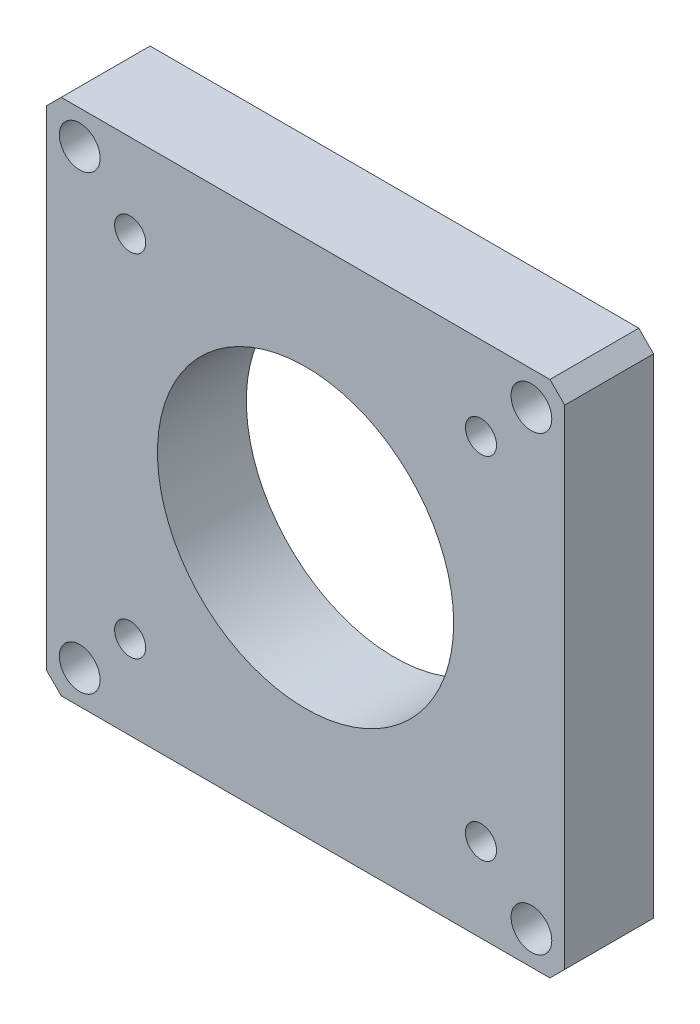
ISO-10303-21;
HEADER;
FILE_DESCRIPTION(('STEP AP214'),'2;1');
FILE_NAME('part.step','',(''),(''),'','','');
FILE_SCHEMA(('AUTOMOTIVE_DESIGN { 1 0 10303 214 1 1 1 1 }'));
ENDSEC;
DATA;
#1=APPLICATION_CONTEXT('core data for automotive mechanical design processes');
#2=APPLICATION_PROTOCOL_DEFINITION('international standard','automotive_design',2000,#1);
#3=PRODUCT_CONTEXT('',#1,'mechanical');
#4=PRODUCT('Part','Part','',(#3));
#5=PRODUCT_RELATED_PRODUCT_CATEGORY('part','',(#4));
#6=PRODUCT_DEFINITION_FORMATION('','',#4);
#7=PRODUCT_DEFINITION_CONTEXT('part definition',#1,'design');
#8=PRODUCT_DEFINITION('design','',#6,#7);
#9=PRODUCT_DEFINITION_SHAPE('','',#8);
#10=(LENGTH_UNIT() NAMED_UNIT(*) SI_UNIT(.MILLI.,.METRE.));
#11=(NAMED_UNIT(*) PLANE_ANGLE_UNIT() SI_UNIT($,.RADIAN.));
#12=(NAMED_UNIT(*) SI_UNIT($,.STERADIAN.) SOLID_ANGLE_UNIT());
#13=UNCERTAINTY_MEASURE_WITH_UNIT(LENGTH_MEASURE(1.E-05),#10,'distance_accuracy_value','');
#14=(GEOMETRIC_REPRESENTATION_CONTEXT(3) GLOBAL_UNCERTAINTY_ASSIGNED_CONTEXT((#13)) GLOBAL_UNIT_ASSIGNED_CONTEXT((#10,
#11,#12)) REPRESENTATION_CONTEXT('',''));
#15=CARTESIAN_POINT('',(0.,0.,0.));
#16=DIRECTION('',(0.,0.,1.));
#17=DIRECTION('',(1.,0.,0.));
#18=AXIS2_PLACEMENT_3D('',#15,#16,#17);
#19=CARTESIAN_POINT('',(76.0000000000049,-7.89685326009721,12.));
#20=DIRECTION('',(-1.,0.,0.));
#21=DIRECTION('',(0.,-1.,0.));
#22=AXIS2_PLACEMENT_3D('',#19,#20,#21);
#23=PLANE('',#22);
#24=DIRECTION('',(0.,1.,0.));
#25=VECTOR('',#24,1.);
#26=CARTESIAN_POINT('',(76.0000000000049,-7.89685326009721,0.));
#27=LINE('',#26,#25);
#28=CARTESIAN_POINT('',(76.0000000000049,-75.8968532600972,0.));
#29=VERTEX_POINT('',#28);
#30=CARTESIAN_POINT('',(76.0000000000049,-9.89685326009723,0.));
#31=VERTEX_POINT('',#30);
#32=EDGE_CURVE('E112',#29,#31,#27,.T.);
#33=ORIENTED_EDGE('',*,*,#32,.T.);
#34=DIRECTION('',(0.,0.,1.));
#35=VECTOR('',#34,1.);
#36=CARTESIAN_POINT('',(76.0000000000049,-9.89685326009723,12.));
#37=LINE('',#36,#35);
#38=CARTESIAN_POINT('',(76.0000000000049,-9.89685326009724,12.));
#39=VERTEX_POINT('',#38);
#40=EDGE_CURVE('E11',#31,#39,#37,.T.);
#41=ORIENTED_EDGE('',*,*,#40,.T.);
#42=DIRECTION('',(0.,1.,0.));
#43=VECTOR('',#42,1.);
#44=CARTESIAN_POINT('',(76.0000000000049,-7.89685326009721,12.));
#45=LINE('',#44,#43);
#46=CARTESIAN_POINT('',(76.0000000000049,-75.8968532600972,12.));
#47=VERTEX_POINT('',#46);
#48=EDGE_CURVE('E110',#47,#39,#45,.T.);
#49=ORIENTED_EDGE('',*,*,#48,.F.);
#50=DIRECTION('',(0.,0.,-1.));
#51=VECTOR('',#50,1.);
#52=CARTESIAN_POINT('',(76.0000000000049,-75.8968532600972,12.));
#53=LINE('',#52,#51);
#54=EDGE_CURVE('E24',#47,#29,#53,.T.);
#55=ORIENTED_EDGE('',*,*,#54,.T.);
#56=EDGE_LOOP('',(#33,#41,#49,#55));
#57=FACE_BOUND('',#56,.T.);
#58=ADVANCED_FACE('F16',(#57),#23,.F.);
#59=CARTESIAN_POINT('',(6.00000000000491,-7.89685326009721,12.));
#60=DIRECTION('',(0.,-1.,0.));
#61=DIRECTION('',(0.,0.,-1.));
#62=AXIS2_PLACEMENT_3D('',#59,#60,#61);
#63=PLANE('',#62);
#64=DIRECTION('',(-1.,0.,0.));
#65=VECTOR('',#64,1.);
#66=CARTESIAN_POINT('',(6.00000000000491,-7.89685326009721,0.));
#67=LINE('',#66,#65);
#68=CARTESIAN_POINT('',(74.0000000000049,-7.8968532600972,0.));
#69=VERTEX_POINT('',#68);
#70=CARTESIAN_POINT('',(8.00000000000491,-7.89685326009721,0.));
#71=VERTEX_POINT('',#70);
#72=EDGE_CURVE('E108',#69,#71,#67,.T.);
#73=ORIENTED_EDGE('',*,*,#72,.T.);
#74=DIRECTION('',(0.,0.,1.));
#75=VECTOR('',#74,1.);
#76=CARTESIAN_POINT('',(8.00000000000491,-7.89685326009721,12.));
#77=LINE('',#76,#75);
#78=CARTESIAN_POINT('',(8.00000000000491,-7.89685326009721,12.));
#79=VERTEX_POINT('',#78);
#80=EDGE_CURVE('E87',#71,#79,#77,.T.);
#81=ORIENTED_EDGE('',*,*,#80,.T.);
#82=DIRECTION('',(-1.,0.,0.));
#83=VECTOR('',#82,1.);
#84=CARTESIAN_POINT('',(6.00000000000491,-7.89685326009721,12.));
#85=LINE('',#84,#83);
#86=CARTESIAN_POINT('',(74.0000000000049,-7.89685326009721,12.));
#87=VERTEX_POINT('',#86);
#88=EDGE_CURVE('E152',#87,#79,#85,.T.);
#89=ORIENTED_EDGE('',*,*,#88,.F.);
#90=DIRECTION('',(0.,0.,-1.));
#91=VECTOR('',#90,1.);
#92=CARTESIAN_POINT('',(74.0000000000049,-7.89685326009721,12.));
#93=LINE('',#92,#91);
#94=EDGE_CURVE('E92',#87,#69,#93,.T.);
#95=ORIENTED_EDGE('',*,*,#94,.T.);
#96=EDGE_LOOP('',(#73,#81,#89,#95));
#97=FACE_BOUND('',#96,.T.);
#98=ADVANCED_FACE('F233',(#97),#63,.F.);
#99=CARTESIAN_POINT('',(6.00000000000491,-7.89685326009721,12.));
#100=DIRECTION('',(1.,0.,0.));
#101=DIRECTION('',(0.,1.,0.));
#102=AXIS2_PLACEMENT_3D('',#99,#100,#101);
#103=PLANE('',#102);
#104=DIRECTION('',(0.,-1.,0.));
#105=VECTOR('',#104,1.);
#106=CARTESIAN_POINT('',(6.00000000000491,-7.89685326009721,12.));
#107=LINE('',#106,#105);
#108=CARTESIAN_POINT('',(6.00000000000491,-9.8968532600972,12.));
#109=VERTEX_POINT('',#108);
#110=CARTESIAN_POINT('',(6.00000000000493,-75.8968532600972,12.));
#111=VERTEX_POINT('',#110);
#112=EDGE_CURVE('E101',#109,#111,#107,.T.);
#113=ORIENTED_EDGE('',*,*,#112,.F.);
#114=DIRECTION('',(0.,0.,-1.));
#115=VECTOR('',#114,1.);
#116=CARTESIAN_POINT('',(6.00000000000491,-9.8968532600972,12.));
#117=LINE('',#116,#115);
#118=CARTESIAN_POINT('',(6.00000000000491,-9.8968532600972,0.));
#119=VERTEX_POINT('',#118);
#120=EDGE_CURVE('E86',#109,#119,#117,.T.);
#121=ORIENTED_EDGE('',*,*,#120,.T.);
#122=DIRECTION('',(0.,-1.,0.));
#123=VECTOR('',#122,1.);
#124=CARTESIAN_POINT('',(6.00000000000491,-7.89685326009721,0.));
#125=LINE('',#124,#123);
#126=CARTESIAN_POINT('',(6.00000000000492,-75.8968532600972,0.));
#127=VERTEX_POINT('',#126);
#128=EDGE_CURVE('E99',#119,#127,#125,.T.);
#129=ORIENTED_EDGE('',*,*,#128,.T.);
#130=DIRECTION('',(0.,0.,1.));
#131=VECTOR('',#130,1.);
#132=CARTESIAN_POINT('',(6.00000000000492,-75.8968532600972,12.));
#133=LINE('',#132,#131);
#134=EDGE_CURVE('E103',#127,#111,#133,.T.);
#135=ORIENTED_EDGE('',*,*,#134,.T.);
#136=EDGE_LOOP('',(#113,#121,#129,#135));
#137=FACE_BOUND('',#136,.T.);
#138=ADVANCED_FACE('F98',(#137),#103,.F.);
#139=CARTESIAN_POINT('',(6.00000000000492,-77.8968532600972,12.));
#140=DIRECTION('',(0.,1.,0.));
#141=DIRECTION('',(0.,0.,1.));
#142=AXIS2_PLACEMENT_3D('',#139,#140,#141);
#143=PLANE('',#142);
#144=DIRECTION('',(1.,0.,0.));
#145=VECTOR('',#144,1.);
#146=CARTESIAN_POINT('',(6.00000000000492,-77.8968532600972,12.));
#147=LINE('',#146,#145);
#148=CARTESIAN_POINT('',(8.00000000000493,-77.8968532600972,12.));
#149=VERTEX_POINT('',#148);
#150=CARTESIAN_POINT('',(74.0000000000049,-77.8968532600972,12.));
#151=VERTEX_POINT('',#150);
#152=EDGE_CURVE('E116',#149,#151,#147,.T.);
#153=ORIENTED_EDGE('',*,*,#152,.F.);
#154=DIRECTION('',(0.,0.,-1.));
#155=VECTOR('',#154,1.);
#156=CARTESIAN_POINT('',(8.00000000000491,-77.8968532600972,12.));
#157=LINE('',#156,#155);
#158=CARTESIAN_POINT('',(8.00000000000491,-77.8968532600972,0.));
#159=VERTEX_POINT('',#158);
#160=EDGE_CURVE('E133',#149,#159,#157,.T.);
#161=ORIENTED_EDGE('',*,*,#160,.T.);
#162=DIRECTION('',(1.,0.,0.));
#163=VECTOR('',#162,1.);
#164=CARTESIAN_POINT('',(6.00000000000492,-77.8968532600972,0.));
#165=LINE('',#164,#163);
#166=CARTESIAN_POINT('',(74.0000000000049,-77.8968532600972,0.));
#167=VERTEX_POINT('',#166);
#168=EDGE_CURVE('E107',#159,#167,#165,.T.);
#169=ORIENTED_EDGE('',*,*,#168,.T.);
#170=DIRECTION('',(0.,0.,1.));
#171=VECTOR('',#170,1.);
#172=CARTESIAN_POINT('',(74.0000000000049,-77.8968532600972,12.));
#173=LINE('',#172,#171);
#174=EDGE_CURVE('E31',#167,#151,#173,.T.);
#175=ORIENTED_EDGE('',*,*,#174,.T.);
#176=EDGE_LOOP('',(#153,#161,#169,#175));
#177=FACE_BOUND('',#176,.T.);
#178=ADVANCED_FACE('F212',(#177),#143,.F.);
#179=CARTESIAN_POINT('',(0.,0.,12.));
#180=DIRECTION('',(0.,0.,1.));
#181=DIRECTION('',(1.,0.,0.));
#182=AXIS2_PLACEMENT_3D('',#179,#180,#181);
#183=PLANE('',#182);
#184=CARTESIAN_POINT('',(71.5000000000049,-12.3968532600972,12.));
#185=DIRECTION('',(0.,0.,1.));
#186=DIRECTION('',(1.,0.,0.));
#187=AXIS2_PLACEMENT_3D('',#184,#185,#186);
#188=CIRCLE('',#187,2.75);
#189=CARTESIAN_POINT('',(74.2500000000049,-12.3968532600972,12.));
#190=VERTEX_POINT('',#189);
#191=EDGE_CURVE('E203',#190,#190,#188,.T.);
#192=ORIENTED_EDGE('',*,*,#191,.F.);
#193=EDGE_LOOP('',(#192));
#194=FACE_BOUND('',#193,.T.);
#195=CARTESIAN_POINT('',(71.5000000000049,-73.3968532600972,12.));
#196=DIRECTION('',(0.,0.,1.));
#197=DIRECTION('',(1.,0.,0.));
#198=AXIS2_PLACEMENT_3D('',#195,#196,#197);
#199=CIRCLE('',#198,2.75);
#200=CARTESIAN_POINT('',(74.2500000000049,-73.3968532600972,12.));
#201=VERTEX_POINT('',#200);
#202=EDGE_CURVE('E197',#201,#201,#199,.T.);
#203=ORIENTED_EDGE('',*,*,#202,.F.);
#204=EDGE_LOOP('',(#203));
#205=FACE_BOUND('',#204,.T.);
#206=CARTESIAN_POINT('',(10.5000000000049,-73.3968532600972,12.));
#207=DIRECTION('',(0.,0.,1.));
#208=DIRECTION('',(1.,0.,0.));
#209=AXIS2_PLACEMENT_3D('',#206,#207,#208);
#210=CIRCLE('',#209,2.75);
#211=CARTESIAN_POINT('',(13.2500000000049,-73.3968532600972,12.));
#212=VERTEX_POINT('',#211);
#213=EDGE_CURVE('E191',#212,#212,#210,.T.);
#214=ORIENTED_EDGE('',*,*,#213,.F.);
#215=EDGE_LOOP('',(#214));
#216=FACE_BOUND('',#215,.T.);
#217=CARTESIAN_POINT('',(10.5000000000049,-12.3968532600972,12.));
#218=DIRECTION('',(0.,0.,1.));
#219=DIRECTION('',(1.,0.,0.));
#220=AXIS2_PLACEMENT_3D('',#217,#218,#219);
#221=CIRCLE('',#220,2.75);
#222=CARTESIAN_POINT('',(13.2500000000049,-12.3968532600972,12.));
#223=VERTEX_POINT('',#222);
#224=EDGE_CURVE('E185',#223,#223,#221,.T.);
#225=ORIENTED_EDGE('',*,*,#224,.F.);
#226=EDGE_LOOP('',(#225));
#227=FACE_BOUND('',#226,.T.);
#228=CARTESIAN_POINT('',(64.6880771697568,-66.5849304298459,12.));
#229=DIRECTION('',(0.,0.,1.));
#230=DIRECTION('',(1.,0.,0.));
#231=AXIS2_PLACEMENT_3D('',#228,#229,#230);
#232=CIRCLE('',#231,2.1);
#233=CARTESIAN_POINT('',(66.7880771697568,-66.5849304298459,12.));
#234=VERTEX_POINT('',#233);
#235=EDGE_CURVE('E179',#234,#234,#232,.T.);
#236=ORIENTED_EDGE('',*,*,#235,.F.);
#237=EDGE_LOOP('',(#236));
#238=FACE_BOUND('',#237,.T.);
#239=CARTESIAN_POINT('',(64.6880771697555,-19.2087760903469,12.));
#240=DIRECTION('',(0.,0.,1.));
#241=DIRECTION('',(1.,0.,0.));
#242=AXIS2_PLACEMENT_3D('',#239,#240,#241);
#243=CIRCLE('',#242,2.1);
#244=CARTESIAN_POINT('',(66.7880771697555,-19.2087760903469,12.));
#245=VERTEX_POINT('',#244);
#246=EDGE_CURVE('E173',#245,#245,#243,.T.);
#247=ORIENTED_EDGE('',*,*,#246,.F.);
#248=EDGE_LOOP('',(#247));
#249=FACE_BOUND('',#248,.T.);
#250=CARTESIAN_POINT('',(17.3119228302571,-19.2087760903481,12.));
#251=DIRECTION('',(0.,0.,1.));
#252=DIRECTION('',(1.,0.,0.));
#253=AXIS2_PLACEMENT_3D('',#250,#251,#252);
#254=CIRCLE('',#253,2.1);
#255=CARTESIAN_POINT('',(19.4119228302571,-19.2087760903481,12.));
#256=VERTEX_POINT('',#255);
#257=EDGE_CURVE('E167',#256,#256,#254,.T.);
#258=ORIENTED_EDGE('',*,*,#257,.F.);
#259=EDGE_LOOP('',(#258));
#260=FACE_BOUND('',#259,.T.);
#261=CARTESIAN_POINT('',(17.3119228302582,-66.5849304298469,12.));
#262=DIRECTION('',(0.,0.,1.));
#263=DIRECTION('',(1.,0.,0.));
#264=AXIS2_PLACEMENT_3D('',#261,#262,#263);
#265=CIRCLE('',#264,2.1);
#266=CARTESIAN_POINT('',(19.4119228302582,-66.5849304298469,12.));
#267=VERTEX_POINT('',#266);
#268=EDGE_CURVE('E161',#267,#267,#265,.T.);
#269=ORIENTED_EDGE('',*,*,#268,.F.);
#270=EDGE_LOOP('',(#269));
#271=FACE_BOUND('',#270,.T.);
#272=CARTESIAN_POINT('',(41.0000000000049,-42.8968532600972,12.));
#273=DIRECTION('',(0.,0.,1.));
#274=DIRECTION('',(1.,0.,0.));
#275=AXIS2_PLACEMENT_3D('',#272,#273,#274);
#276=CIRCLE('',#275,20.);
#277=CARTESIAN_POINT('',(61.0000000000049,-42.8968532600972,12.));
#278=VERTEX_POINT('',#277);
#279=EDGE_CURVE('E147',#278,#278,#276,.T.);
#280=ORIENTED_EDGE('',*,*,#279,.F.);
#281=EDGE_LOOP('',(#280));
#282=FACE_BOUND('',#281,.T.);
#283=ORIENTED_EDGE('',*,*,#88,.T.);
#284=DIRECTION('',(0.70710678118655,0.707106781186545,0.));
#285=VECTOR('',#284,1.);
#286=CARTESIAN_POINT('',(7.94842663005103,-7.94842663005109,12.));
#287=LINE('',#286,#285);
#288=EDGE_CURVE('E130',#79,#109,#287,.F.);
#289=ORIENTED_EDGE('',*,*,#288,.T.);
#290=ORIENTED_EDGE('',*,*,#112,.T.);
#291=DIRECTION('',(-0.707106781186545,0.70710678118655,0.));
#292=VECTOR('',#291,1.);
#293=CARTESIAN_POINT('',(-34.9484266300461,-34.9484266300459,12.));
#294=LINE('',#293,#292);
#295=EDGE_CURVE('E38',#111,#149,#294,.F.);
#296=ORIENTED_EDGE('',*,*,#295,.T.);
#297=ORIENTED_EDGE('',*,*,#152,.T.);
#298=DIRECTION('',(-0.707106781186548,-0.707106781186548,0.));
#299=VECTOR('',#298,1.);
#300=CARTESIAN_POINT('',(75.9484266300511,-75.9484266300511,12.));
#301=LINE('',#300,#299);
#302=EDGE_CURVE('E125',#151,#47,#301,.F.);
#303=ORIENTED_EDGE('',*,*,#302,.T.);
#304=ORIENTED_EDGE('',*,*,#48,.T.);
#305=DIRECTION('',(0.70710678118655,-0.707106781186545,0.));
#306=VECTOR('',#305,1.);
#307=CARTESIAN_POINT('',(33.0515733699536,33.0515733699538,12.));
#308=LINE('',#307,#306);
#309=EDGE_CURVE('E127',#39,#87,#308,.F.);
#310=ORIENTED_EDGE('',*,*,#309,.T.);
#311=EDGE_LOOP('',(#283,#289,#290,#296,#297,#303,#304,#310));
#312=FACE_BOUND('',#311,.T.);
#313=ADVANCED_FACE('F209',(#194,#205,#216,#227,#238,#249,#260,#271,#282,#312),#183,.T.);
#314=CARTESIAN_POINT('',(0.,0.,0.));
#315=DIRECTION('',(0.,0.,1.));
#316=DIRECTION('',(1.,0.,0.));
#317=AXIS2_PLACEMENT_3D('',#314,#315,#316);
#318=PLANE('',#317);
#319=CARTESIAN_POINT('',(71.5000000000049,-12.3968532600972,0.));
#320=DIRECTION('',(0.,0.,1.));
#321=DIRECTION('',(1.,0.,0.));
#322=AXIS2_PLACEMENT_3D('',#319,#320,#321);
#323=CIRCLE('',#322,2.75);
#324=CARTESIAN_POINT('',(74.2500000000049,-12.3968532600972,0.));
#325=VERTEX_POINT('',#324);
#326=EDGE_CURVE('E200',#325,#325,#323,.T.);
#327=ORIENTED_EDGE('',*,*,#326,.T.);
#328=EDGE_LOOP('',(#327));
#329=FACE_BOUND('',#328,.T.);
#330=CARTESIAN_POINT('',(71.5000000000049,-73.3968532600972,0.));
#331=DIRECTION('',(0.,0.,1.));
#332=DIRECTION('',(1.,0.,0.));
#333=AXIS2_PLACEMENT_3D('',#330,#331,#332);
#334=CIRCLE('',#333,2.75);
#335=CARTESIAN_POINT('',(74.2500000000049,-73.3968532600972,0.));
#336=VERTEX_POINT('',#335);
#337=EDGE_CURVE('E194',#336,#336,#334,.T.);
#338=ORIENTED_EDGE('',*,*,#337,.T.);
#339=EDGE_LOOP('',(#338));
#340=FACE_BOUND('',#339,.T.);
#341=CARTESIAN_POINT('',(10.5000000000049,-73.3968532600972,0.));
#342=DIRECTION('',(0.,0.,1.));
#343=DIRECTION('',(1.,0.,0.));
#344=AXIS2_PLACEMENT_3D('',#341,#342,#343);
#345=CIRCLE('',#344,2.75);
#346=CARTESIAN_POINT('',(13.2500000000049,-73.3968532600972,0.));
#347=VERTEX_POINT('',#346);
#348=EDGE_CURVE('E188',#347,#347,#345,.T.);
#349=ORIENTED_EDGE('',*,*,#348,.T.);
#350=EDGE_LOOP('',(#349));
#351=FACE_BOUND('',#350,.T.);
#352=CARTESIAN_POINT('',(10.5000000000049,-12.3968532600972,0.));
#353=DIRECTION('',(0.,0.,1.));
#354=DIRECTION('',(1.,0.,0.));
#355=AXIS2_PLACEMENT_3D('',#352,#353,#354);
#356=CIRCLE('',#355,2.75);
#357=CARTESIAN_POINT('',(13.2500000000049,-12.3968532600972,0.));
#358=VERTEX_POINT('',#357);
#359=EDGE_CURVE('E182',#358,#358,#356,.T.);
#360=ORIENTED_EDGE('',*,*,#359,.T.);
#361=EDGE_LOOP('',(#360));
#362=FACE_BOUND('',#361,.T.);
#363=CARTESIAN_POINT('',(64.6880771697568,-66.5849304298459,0.));
#364=DIRECTION('',(0.,0.,1.));
#365=DIRECTION('',(1.,0.,0.));
#366=AXIS2_PLACEMENT_3D('',#363,#364,#365);
#367=CIRCLE('',#366,2.1);
#368=CARTESIAN_POINT('',(66.7880771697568,-66.5849304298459,0.));
#369=VERTEX_POINT('',#368);
#370=EDGE_CURVE('E176',#369,#369,#367,.T.);
#371=ORIENTED_EDGE('',*,*,#370,.T.);
#372=EDGE_LOOP('',(#371));
#373=FACE_BOUND('',#372,.T.);
#374=CARTESIAN_POINT('',(64.6880771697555,-19.2087760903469,0.));
#375=DIRECTION('',(0.,0.,1.));
#376=DIRECTION('',(1.,0.,0.));
#377=AXIS2_PLACEMENT_3D('',#374,#375,#376);
#378=CIRCLE('',#377,2.1);
#379=CARTESIAN_POINT('',(66.7880771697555,-19.2087760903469,0.));
#380=VERTEX_POINT('',#379);
#381=EDGE_CURVE('E170',#380,#380,#378,.T.);
#382=ORIENTED_EDGE('',*,*,#381,.T.);
#383=EDGE_LOOP('',(#382));
#384=FACE_BOUND('',#383,.T.);
#385=CARTESIAN_POINT('',(17.3119228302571,-19.2087760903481,0.));
#386=DIRECTION('',(0.,0.,1.));
#387=DIRECTION('',(1.,0.,0.));
#388=AXIS2_PLACEMENT_3D('',#385,#386,#387);
#389=CIRCLE('',#388,2.1);
#390=CARTESIAN_POINT('',(19.4119228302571,-19.2087760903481,0.));
#391=VERTEX_POINT('',#390);
#392=EDGE_CURVE('E164',#391,#391,#389,.T.);
#393=ORIENTED_EDGE('',*,*,#392,.T.);
#394=EDGE_LOOP('',(#393));
#395=FACE_BOUND('',#394,.T.);
#396=CARTESIAN_POINT('',(17.3119228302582,-66.5849304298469,0.));
#397=DIRECTION('',(0.,0.,1.));
#398=DIRECTION('',(1.,0.,0.));
#399=AXIS2_PLACEMENT_3D('',#396,#397,#398);
#400=CIRCLE('',#399,2.1);
#401=CARTESIAN_POINT('',(19.4119228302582,-66.5849304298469,0.));
#402=VERTEX_POINT('',#401);
#403=EDGE_CURVE('E157',#402,#402,#400,.T.);
#404=ORIENTED_EDGE('',*,*,#403,.T.);
#405=EDGE_LOOP('',(#404));
#406=FACE_BOUND('',#405,.T.);
#407=CARTESIAN_POINT('',(41.0000000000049,-42.8968532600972,0.));
#408=DIRECTION('',(0.,0.,1.));
#409=DIRECTION('',(1.,0.,0.));
#410=AXIS2_PLACEMENT_3D('',#407,#408,#409);
#411=CIRCLE('',#410,20.);
#412=CARTESIAN_POINT('',(61.0000000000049,-42.8968532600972,0.));
#413=VERTEX_POINT('',#412);
#414=EDGE_CURVE('E145',#413,#413,#411,.T.);
#415=ORIENTED_EDGE('',*,*,#414,.T.);
#416=EDGE_LOOP('',(#415));
#417=FACE_BOUND('',#416,.T.);
#418=ORIENTED_EDGE('',*,*,#128,.F.);
#419=DIRECTION('',(-0.70710678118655,-0.707106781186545,0.));
#420=VECTOR('',#419,1.);
#421=CARTESIAN_POINT('',(6.00000000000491,-9.8968532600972,0.));
#422=LINE('',#421,#420);
#423=EDGE_CURVE('E82',#119,#71,#422,.F.);
#424=ORIENTED_EDGE('',*,*,#423,.T.);
#425=ORIENTED_EDGE('',*,*,#72,.F.);
#426=DIRECTION('',(-0.70710678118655,0.707106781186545,0.));
#427=VECTOR('',#426,1.);
#428=CARTESIAN_POINT('',(74.0000000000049,-7.89685326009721,0.));
#429=LINE('',#428,#427);
#430=EDGE_CURVE('E119',#69,#31,#429,.F.);
#431=ORIENTED_EDGE('',*,*,#430,.T.);
#432=ORIENTED_EDGE('',*,*,#32,.F.);
#433=DIRECTION('',(0.707106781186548,0.707106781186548,0.));
#434=VECTOR('',#433,1.);
#435=CARTESIAN_POINT('',(76.0000000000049,-75.8968532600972,0.));
#436=LINE('',#435,#434);
#437=EDGE_CURVE('E102',#29,#167,#436,.F.);
#438=ORIENTED_EDGE('',*,*,#437,.T.);
#439=ORIENTED_EDGE('',*,*,#168,.F.);
#440=DIRECTION('',(0.707106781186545,-0.70710678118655,0.));
#441=VECTOR('',#440,1.);
#442=CARTESIAN_POINT('',(8.00000000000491,-77.8968532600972,0.));
#443=LINE('',#442,#441);
#444=EDGE_CURVE('E93',#159,#127,#443,.F.);
#445=ORIENTED_EDGE('',*,*,#444,.T.);
#446=EDGE_LOOP('',(#418,#424,#425,#431,#432,#438,#439,#445));
#447=FACE_BOUND('',#446,.T.);
#448=ADVANCED_FACE('F105',(#329,#340,#351,#362,#373,#384,#395,#406,#417,#447),#318,.F.);
#449=CARTESIAN_POINT('',(41.0000000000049,-42.8968532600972,0.));
#450=DIRECTION('',(0.,0.,1.));
#451=DIRECTION('',(1.,0.,0.));
#452=AXIS2_PLACEMENT_3D('',#449,#450,#451);
#453=CYLINDRICAL_SURFACE('',#452,20.);
#454=ORIENTED_EDGE('',*,*,#414,.F.);
#455=EDGE_LOOP('',(#454));
#456=FACE_BOUND('',#455,.T.);
#457=ORIENTED_EDGE('',*,*,#279,.T.);
#458=EDGE_LOOP('',(#457));
#459=FACE_BOUND('',#458,.T.);
#460=ADVANCED_FACE('F268',(#456,#459),#453,.F.);
#461=CARTESIAN_POINT('',(17.3119228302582,-66.5849304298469,12.));
#462=DIRECTION('',(0.,0.,1.));
#463=DIRECTION('',(1.,0.,0.));
#464=AXIS2_PLACEMENT_3D('',#461,#462,#463);
#465=CYLINDRICAL_SURFACE('',#464,2.1);
#466=ORIENTED_EDGE('',*,*,#403,.F.);
#467=EDGE_LOOP('',(#466));
#468=FACE_BOUND('',#467,.T.);
#469=ORIENTED_EDGE('',*,*,#268,.T.);
#470=EDGE_LOOP('',(#469));
#471=FACE_BOUND('',#470,.T.);
#472=ADVANCED_FACE('F273',(#468,#471),#465,.F.);
#473=CARTESIAN_POINT('',(17.3119228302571,-19.2087760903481,12.));
#474=DIRECTION('',(0.,0.,1.));
#475=DIRECTION('',(1.,0.,0.));
#476=AXIS2_PLACEMENT_3D('',#473,#474,#475);
#477=CYLINDRICAL_SURFACE('',#476,2.1);
#478=ORIENTED_EDGE('',*,*,#392,.F.);
#479=EDGE_LOOP('',(#478));
#480=FACE_BOUND('',#479,.T.);
#481=ORIENTED_EDGE('',*,*,#257,.T.);
#482=EDGE_LOOP('',(#481));
#483=FACE_BOUND('',#482,.T.);
#484=ADVANCED_FACE('F277',(#480,#483),#477,.F.);
#485=CARTESIAN_POINT('',(64.6880771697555,-19.2087760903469,12.));
#486=DIRECTION('',(0.,0.,1.));
#487=DIRECTION('',(1.,0.,0.));
#488=AXIS2_PLACEMENT_3D('',#485,#486,#487);
#489=CYLINDRICAL_SURFACE('',#488,2.1);
#490=ORIENTED_EDGE('',*,*,#381,.F.);
#491=EDGE_LOOP('',(#490));
#492=FACE_BOUND('',#491,.T.);
#493=ORIENTED_EDGE('',*,*,#246,.T.);
#494=EDGE_LOOP('',(#493));
#495=FACE_BOUND('',#494,.T.);
#496=ADVANCED_FACE('F281',(#492,#495),#489,.F.);
#497=CARTESIAN_POINT('',(64.6880771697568,-66.5849304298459,12.));
#498=DIRECTION('',(0.,0.,1.));
#499=DIRECTION('',(1.,0.,0.));
#500=AXIS2_PLACEMENT_3D('',#497,#498,#499);
#501=CYLINDRICAL_SURFACE('',#500,2.1);
#502=ORIENTED_EDGE('',*,*,#370,.F.);
#503=EDGE_LOOP('',(#502));
#504=FACE_BOUND('',#503,.T.);
#505=ORIENTED_EDGE('',*,*,#235,.T.);
#506=EDGE_LOOP('',(#505));
#507=FACE_BOUND('',#506,.T.);
#508=ADVANCED_FACE('F285',(#504,#507),#501,.F.);
#509=CARTESIAN_POINT('',(10.5000000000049,-12.3968532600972,12.));
#510=DIRECTION('',(0.,0.,1.));
#511=DIRECTION('',(1.,0.,0.));
#512=AXIS2_PLACEMENT_3D('',#509,#510,#511);
#513=CYLINDRICAL_SURFACE('',#512,2.75);
#514=ORIENTED_EDGE('',*,*,#359,.F.);
#515=EDGE_LOOP('',(#514));
#516=FACE_BOUND('',#515,.T.);
#517=ORIENTED_EDGE('',*,*,#224,.T.);
#518=EDGE_LOOP('',(#517));
#519=FACE_BOUND('',#518,.T.);
#520=ADVANCED_FACE('F289',(#516,#519),#513,.F.);
#521=CARTESIAN_POINT('',(10.5000000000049,-73.3968532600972,12.));
#522=DIRECTION('',(0.,0.,1.));
#523=DIRECTION('',(1.,0.,0.));
#524=AXIS2_PLACEMENT_3D('',#521,#522,#523);
#525=CYLINDRICAL_SURFACE('',#524,2.75);
#526=ORIENTED_EDGE('',*,*,#348,.F.);
#527=EDGE_LOOP('',(#526));
#528=FACE_BOUND('',#527,.T.);
#529=ORIENTED_EDGE('',*,*,#213,.T.);
#530=EDGE_LOOP('',(#529));
#531=FACE_BOUND('',#530,.T.);
#532=ADVANCED_FACE('F293',(#528,#531),#525,.F.);
#533=CARTESIAN_POINT('',(71.5000000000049,-73.3968532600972,12.));
#534=DIRECTION('',(0.,0.,1.));
#535=DIRECTION('',(1.,0.,0.));
#536=AXIS2_PLACEMENT_3D('',#533,#534,#535);
#537=CYLINDRICAL_SURFACE('',#536,2.75);
#538=ORIENTED_EDGE('',*,*,#337,.F.);
#539=EDGE_LOOP('',(#538));
#540=FACE_BOUND('',#539,.T.);
#541=ORIENTED_EDGE('',*,*,#202,.T.);
#542=EDGE_LOOP('',(#541));
#543=FACE_BOUND('',#542,.T.);
#544=ADVANCED_FACE('F297',(#540,#543),#537,.F.);
#545=CARTESIAN_POINT('',(71.5000000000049,-12.3968532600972,12.));
#546=DIRECTION('',(0.,0.,1.));
#547=DIRECTION('',(1.,0.,0.));
#548=AXIS2_PLACEMENT_3D('',#545,#546,#547);
#549=CYLINDRICAL_SURFACE('',#548,2.75);
#550=ORIENTED_EDGE('',*,*,#326,.F.);
#551=EDGE_LOOP('',(#550));
#552=FACE_BOUND('',#551,.T.);
#553=ORIENTED_EDGE('',*,*,#191,.T.);
#554=EDGE_LOOP('',(#553));
#555=FACE_BOUND('',#554,.T.);
#556=ADVANCED_FACE('F207',(#552,#555),#549,.F.);
#557=CARTESIAN_POINT('',(6.00000000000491,-9.8968532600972,12.));
#558=DIRECTION('',(0.707106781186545,-0.70710678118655,0.));
#559=DIRECTION('',(0.,0.,-1.));
#560=AXIS2_PLACEMENT_3D('',#557,#558,#559);
#561=PLANE('',#560);
#562=ORIENTED_EDGE('',*,*,#288,.F.);
#563=ORIENTED_EDGE('',*,*,#80,.F.);
#564=ORIENTED_EDGE('',*,*,#423,.F.);
#565=ORIENTED_EDGE('',*,*,#120,.F.);
#566=EDGE_LOOP('',(#562,#563,#564,#565));
#567=FACE_BOUND('',#566,.T.);
#568=ADVANCED_FACE('F85',(#567),#561,.F.);
#569=CARTESIAN_POINT('',(8.00000000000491,-77.8968532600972,12.));
#570=DIRECTION('',(0.70710678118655,0.707106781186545,0.));
#571=DIRECTION('',(0.,0.,-1.));
#572=AXIS2_PLACEMENT_3D('',#569,#570,#571);
#573=PLANE('',#572);
#574=ORIENTED_EDGE('',*,*,#295,.F.);
#575=ORIENTED_EDGE('',*,*,#134,.F.);
#576=ORIENTED_EDGE('',*,*,#444,.F.);
#577=ORIENTED_EDGE('',*,*,#160,.F.);
#578=EDGE_LOOP('',(#574,#575,#576,#577));
#579=FACE_BOUND('',#578,.T.);
#580=ADVANCED_FACE('F242',(#579),#573,.F.);
#581=CARTESIAN_POINT('',(74.0000000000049,-7.89685326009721,12.));
#582=DIRECTION('',(-0.707106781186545,-0.70710678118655,0.));
#583=DIRECTION('',(0.,0.,-1.));
#584=AXIS2_PLACEMENT_3D('',#581,#582,#583);
#585=PLANE('',#584);
#586=ORIENTED_EDGE('',*,*,#309,.F.);
#587=ORIENTED_EDGE('',*,*,#40,.F.);
#588=ORIENTED_EDGE('',*,*,#430,.F.);
#589=ORIENTED_EDGE('',*,*,#94,.F.);
#590=EDGE_LOOP('',(#586,#587,#588,#589));
#591=FACE_BOUND('',#590,.T.);
#592=ADVANCED_FACE('F235',(#591),#585,.F.);
#593=CARTESIAN_POINT('',(76.0000000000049,-75.8968532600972,12.));
#594=DIRECTION('',(-0.707106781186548,0.707106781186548,0.));
#595=DIRECTION('',(0.,0.,-1.));
#596=AXIS2_PLACEMENT_3D('',#593,#594,#595);
#597=PLANE('',#596);
#598=ORIENTED_EDGE('',*,*,#302,.F.);
#599=ORIENTED_EDGE('',*,*,#174,.F.);
#600=ORIENTED_EDGE('',*,*,#437,.F.);
#601=ORIENTED_EDGE('',*,*,#54,.F.);
#602=EDGE_LOOP('',(#598,#599,#600,#601));
#603=FACE_BOUND('',#602,.T.);
#604=ADVANCED_FACE('F18',(#603),#597,.F.);
#605=CLOSED_SHELL('',(#58,#98,#138,#178,#313,#448,#460,#472,#484,#496,#508,#520,#532,#544,#556,
#568,#580,#592,#604));
#606=MANIFOLD_SOLID_BREP('B1',#605);
#607=ADVANCED_BREP_SHAPE_REPRESENTATION('',(#18,#606),#14);
#608=SHAPE_DEFINITION_REPRESENTATION(#9,#607);
ENDSEC;
END-ISO-10303-21;
